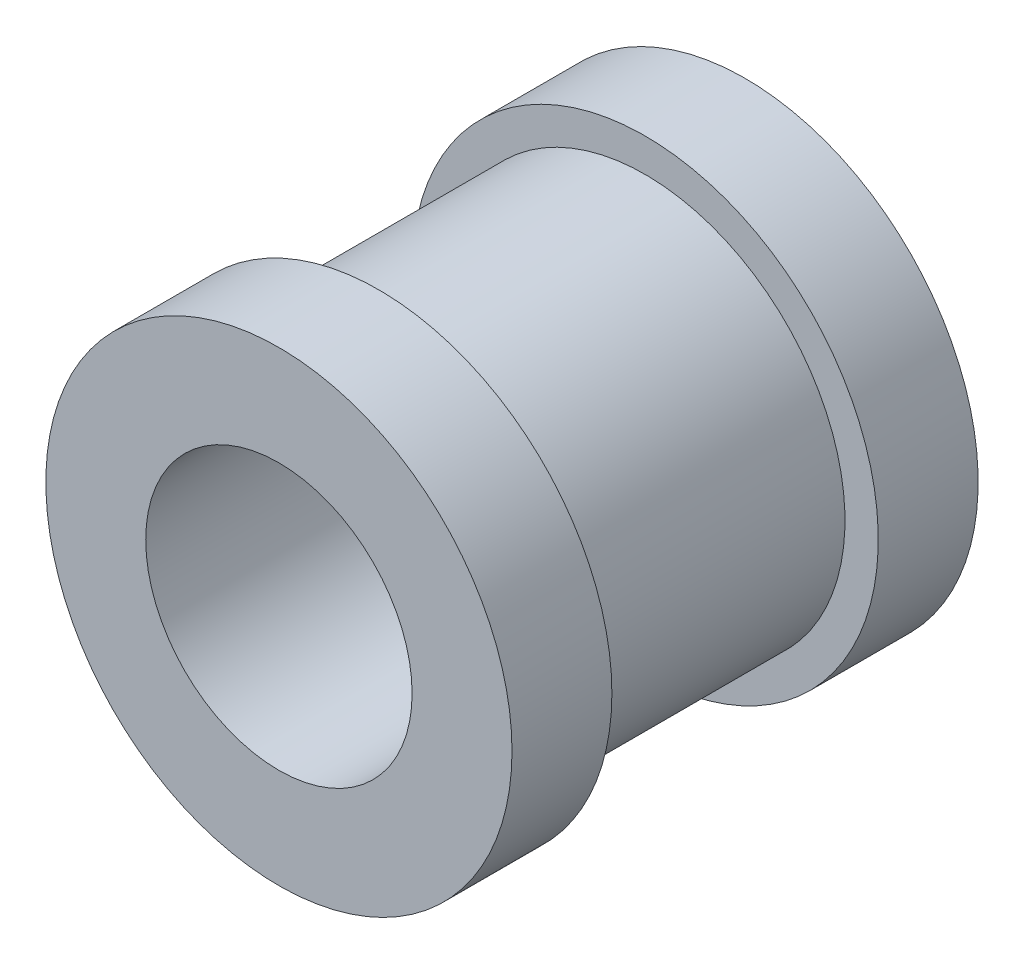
from build123d import *

# Parameters (mm, degrees)
SKETCH1_R           = 6
SKETCH1_R_2         = 4
BOSS_EXTRUDE1_DEPTH = 7
BOSS_EXTRUDE2_START = -3
SKETCH2_R           = 7
SKETCH2_R_2         = 6
BOSS_EXTRUDE2_DEPTH = 3
SKETCH3_R           = 7
SKETCH3_R_2         = 6
BOSS_EXTRUDE3_DEPTH = 3


with BuildPart() as part:
    # Sketch1 → Boss-Extrude1 (new, symmetric)
    with BuildSketch(Plane.XY):
        Circle(SKETCH1_R)
        Circle(SKETCH1_R_2, mode=Mode.SUBTRACT)
    extrude(amount=BOSS_EXTRUDE1_DEPTH, both=True)

    # Sketch2 → Boss-Extrude2 (add)
    with BuildSketch(Plane(origin=(0, 0, -7), x_dir=(-1, 0, 0), z_dir=(0, 0, -1)).offset(BOSS_EXTRUDE2_START)):
        Circle(SKETCH2_R)
        Circle(SKETCH2_R_2, mode=Mode.SUBTRACT)
    extrude(amount=BOSS_EXTRUDE2_DEPTH)

    # Sketch3 → Boss-Extrude3 (add)
    with BuildSketch(Plane.XY.offset(7)):
        with Locations(Location((0, 0, 0), (0, 0, 180))):
            Circle(SKETCH3_R)
        with Locations(Location((0, 0, 0), (0, 0, 180))):
            Circle(SKETCH3_R_2, mode=Mode.SUBTRACT)
    extrude(amount=-BOSS_EXTRUDE3_DEPTH)


solid = part.part
